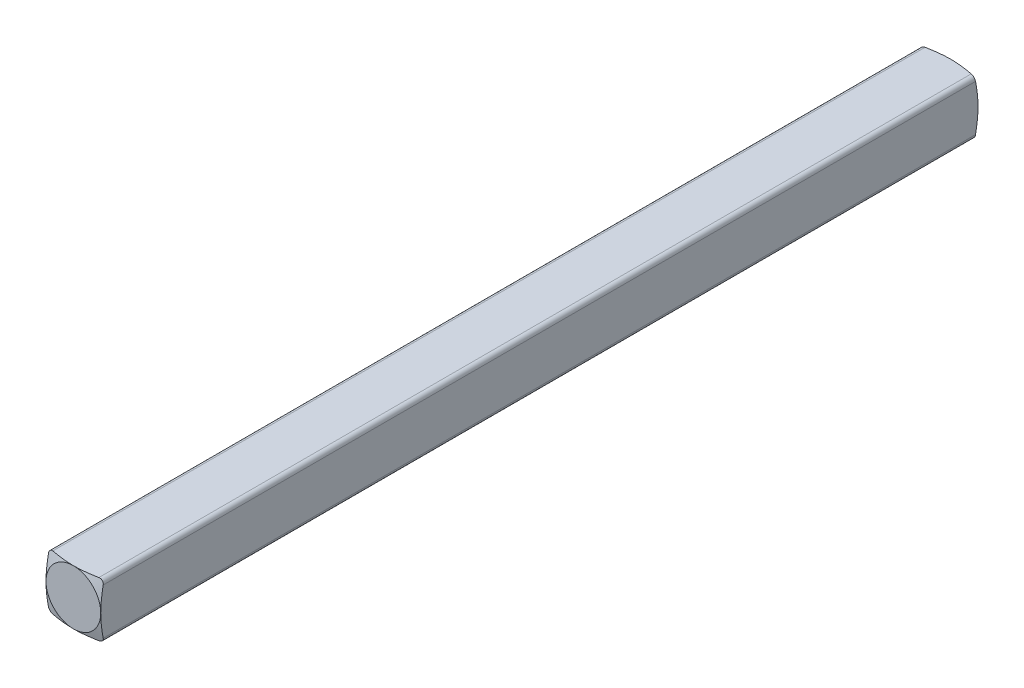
from build123d import *

# Parameters (mm, degrees)
SKETCH1_W      = 3.17
SKETCH1_H      = 3.17
EXTRUDE1_DEPTH = 25.4
FILLET1_R      = 0.25


with BuildPart() as part:
    # Sketch1 → Extrude1 (new, symmetric)
    with BuildSketch(Plane.XY):
        with Locations((0.050122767, 0)):
            Rectangle(SKETCH1_W, SKETCH1_H)
    extrude(amount=EXTRUDE1_DEPTH, both=True)

    # Sketch4 → Cut-Revolve3 (revolve, cut)
    with BuildSketch(Plane.XZ):
        Polygon((1.635122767, 25.4), (2.555122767, 25.4), (2.555122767, 25.13), align=None)
    cut_revolve3 = revolve(axis=Axis((0.050122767, 0, -25.4), (0, 0, 1)), mode=Mode.SUBTRACT)

    # Mirror2: Cut-Revolve3 across plane
    add(cut_revolve3.mirror(Plane.XY), mode=Mode.SUBTRACT)

    # Fillet1
    fillet1_edges = [part.edges().sort_by_distance(p)[0] for p in [
        (1.635122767, 1.585, 0),
        (1.635122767, -1.585, 0),
        (-1.534877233, -1.585, 0),
        (-1.534877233, 1.585, 0),
    ]]
    fillet(fillet1_edges, radius=FILLET1_R)


solid = part.part
